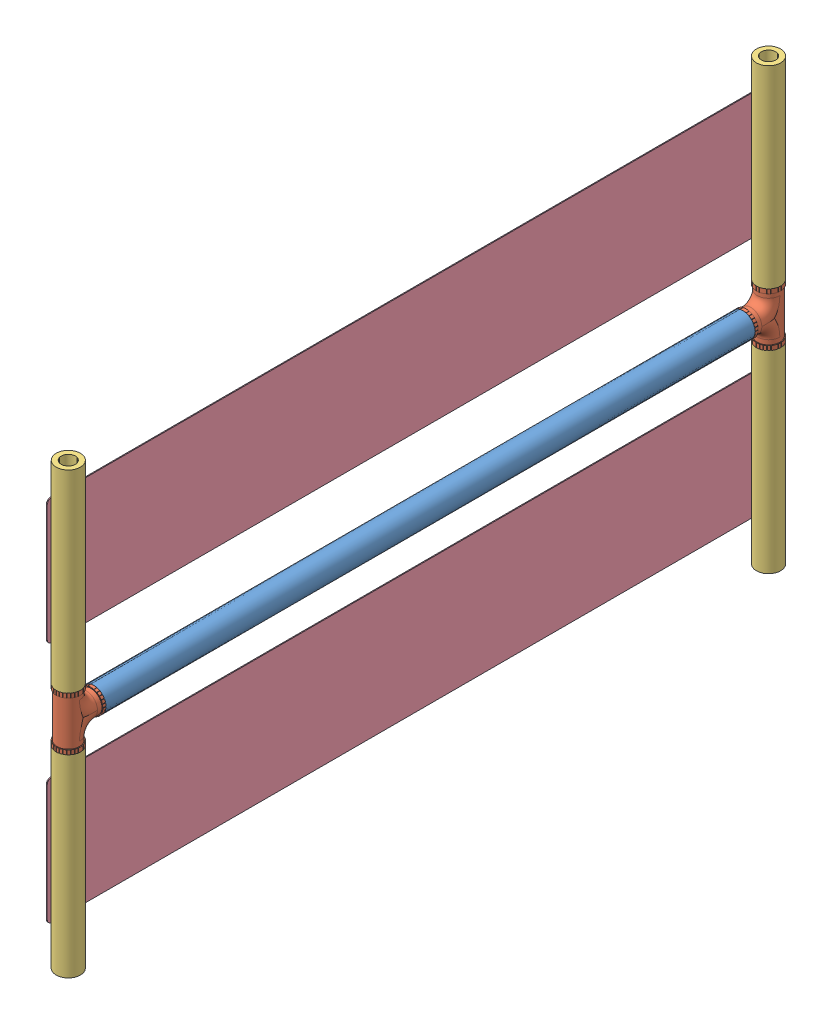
SolidWorks assembly CP003_CAD_Assy.SLDASM, configuration Default (file format 12000). Lengths in mm.
Overall size (28.35 490 807.23).
9 component instances, 4 part files, 24 mates.
Components (placement in the parent):
- CP003_CAD_Tube_L-1: CP003_CAD_Tube_L.SLDPRT [Default] at (222.3691 367.7474 997.1395) size (27 27 730)
- CP003_CAD_Tee-1: CP003_CAD_Tee.SLDPRT [Default] at (222.3691 346.2474 1022.1395) x (-1 0 0) z (0 1 0) size (27.35 42 59.5)
- CP003_CAD_Tee-2: CP003_CAD_Tee.SLDPRT [Default] at (222.3691 346.2474 242.1395) x (1 0 0) z (0 1 0) size (27.35 42 59.5)
- CP003_CAD_Tube_S-1: CP003_CAD_Tube_S.SLDPRT [Default] at (222.3691 122.7474 1022.1395) x (0 0 1) z (0 -1 0) size (27 27 220)
- CP003_CAD_Tube_S-2: CP003_CAD_Tube_S.SLDPRT [Default] at (222.3691 392.7474 1022.1395) x (0 0 1) z (0 -1 0) size (27 27 220)
- CP003_CAD_Tube_S-3: CP003_CAD_Tube_S.SLDPRT [Default] at (222.3691 392.7474 242.1395) x (-0.017452 0 0.999848) z (0 -1 0) size (27 27 220)
- CP003_CAD_Tube_S-4: CP003_CAD_Tube_S.SLDPRT [Default] at (222.3691 122.7474 242.1395) x (0 0 1) z (0 -1 0) size (27 27 220)
- CP003_CAD_Sheet-1: CP003_CAD_Sheet.SLDPRT [Default] at (208.8691 232.7474 632.1395) x (0 1 0) z (-1 0 0) size (140 800 1)
- CP003_CAD_Sheet-2: CP003_CAD_Sheet.SLDPRT [Default] at (208.8691 502.7474 632.1395) x (0 1 0) z (-1 0 0) size (140 800 1)
Mates (geometry in assembly coordinates):
- Concentric1: concentric aligned: cylinder of Colombia_PlayPen_Tube_L-1 through (222.3691 367.7474 267.1395) axis (0 0 1) radius 13.5; cylinder of Colombia_PlayPen_Tee-1 through (222.3691 367.7474 967.1395) axis (0 0 1) radius 13.5
- Coincident1: coincident aligned: plane of Colombia_PlayPen_Tube_L-1 through (222.3691 367.7474 997.1395) normal (0 0 1); plane of Colombia_PlayPen_Tee-1 through (222.3691 367.7474 997.1395) normal (0 0 1)
- Coincident2: coincident anti-aligned: plane of Colombia_PlayPen_Tube_L-1 through (222.3691 367.7474 997.1395) normal (1 0 0); plane of Colombia_PlayPen_Tee-1 through (222.3691 346.2474 1022.1395) normal (-1 0 0)
- Concentric2: concentric anti-aligned: cylinder of Colombia_PlayPen_Tube_L-1 through (222.3691 367.7474 267.1395) axis (0 0 1) radius 13.5; cylinder of Colombia_PlayPen_Tee-2 through (222.3691 367.7474 297.1395) axis (0 0 -1) radius 13.5
- Coincident3: coincident aligned: plane of Colombia_PlayPen_Tube_L-1 through (222.3691 367.7474 267.1395) normal (0 0 -1); plane of Colombia_PlayPen_Tee-2 through (222.3691 367.7474 267.1395) normal (0 0 -1)
- Coincident4: coincident aligned: plane of Colombia_PlayPen_Tube_L-1 through (222.3691 367.7474 997.1395) normal (1 0 0); plane of Colombia_PlayPen_Tee-2 through (222.3691 346.2474 242.1395) normal (1 0 0)
- Concentric4: concentric anti-aligned: cylinder of Colombia_PlayPen_Tee-1 through (222.3691 316.2474 1022.1395) axis (0 1 0) radius 13.5; cylinder of Colombia_PlayPen_Tube_S-1 through (222.3691 342.7474 1022.1395) axis (0 -1 0) radius 13.5
- Coincident5: coincident aligned: plane of Colombia_PlayPen_Tee-1 through (222.3691 342.7474 1022.1395) normal (0 1 0); plane of Colombia_PlayPen_Tube_S-1 through (222.3691 342.7474 1022.1395) normal (0 1 0)
- Concentric5: concentric aligned: cylinder of Colombia_PlayPen_Tee-1 through (222.3691 419.2474 1022.1395) axis (0 -1 0) radius 13.5; cylinder of Colombia_PlayPen_Tube_S-2 through (222.3691 612.7474 1022.1395) axis (0 -1 0) radius 13.5
- Coincident6: coincident aligned: plane of Colombia_PlayPen_Tee-1 through (222.3691 392.7474 1022.1395) normal (0 -1 0); plane of Colombia_PlayPen_Tube_S-2 through (222.3691 392.7474 1022.1395) normal (0 -1 0)
- Concentric6: concentric anti-aligned: cylinder of Colombia_PlayPen_Tee-2 through (222.3691 316.2474 242.1395) axis (0 1 0) radius 13.5; cylinder of Colombia_PlayPen_Tube_S-4 through (222.3691 342.7474 242.1395) axis (0 -1 0) radius 13.5
- Coincident7: coincident aligned: plane of Colombia_PlayPen_Tee-2 through (222.3691 342.7474 242.1395) normal (0 1 0); plane of Colombia_PlayPen_Tube_S-4 through (222.3691 342.7474 242.1395) normal (0 1 0)
- Concentric7: concentric aligned: cylinder of Colombia_PlayPen_Tee-2 through (222.3691 419.2474 242.1395) axis (0 -1 0) radius 13.5; cylinder of Colombia_PlayPen_Tube_S-3 through (222.3691 612.7474 242.1395) axis (0 -1 0) radius 13.5
- Coincident8: coincident aligned: plane of Colombia_PlayPen_Tee-2 through (222.3691 392.7474 242.1395) normal (0 -1 0); plane of Colombia_PlayPen_Tube_S-3 through (222.3691 392.7474 242.1395) normal (0 -1 0)
- Perpendicular1: perpendicular: plane of Colombia_PlayPen_Tube_S-1 through (222.3691 122.7474 1022.1395) normal (-1 0 0)
- Angle1: planar angle = 1.570796 rad anti-aligned: plane of Colombia_PlayPen_Tube_S-2 through (222.3691 392.7474 1022.1395) normal (-1 0 0)
- Angle2: planar angle = 1.553343 rad anti-aligned: plane of Colombia_PlayPen_Tube_S-3 through (222.3691 392.7474 242.1395) normal (-0.999848 0 -0.017452)
- Perpendicular4: perpendicular: plane of Colombia_PlayPen_Tube_S-4 through (222.3691 122.7474 242.1395) normal (-1 0 0)
- Tangent1: tangent anti-aligned: cylinder of Colombia_PlayPen_Tube_S-4 through (222.3691 342.7474 242.1395) axis (0 -1 0) radius 13.5; plane of Colombia_PlayPen_Sheets-1 through (208.8691 167.7474 1027.1395) normal (1 0 0)
- Coincident13: coincident aligned: cylinder of Colombia_PlayPen_Tube_S-4 through (208.8691 182.7474 242.1395) axis (-1 0 0) radius 2; circle of Colombia_PlayPen_Sheets-1
- Concentric8: concentric anti-aligned: cylinder of Colombia_PlayPen_Tube_S-4 through (208.8691 282.7474 242.1395) axis (-1 0 0) radius 2; cylinder of Colombia_PlayPen_Sheets-1 through (207.8691 282.7474 242.1395) axis (1 0 0) radius 2
- Concentric9: concentric aligned: cylinder of Colombia_PlayPen_Tube_S-2 through (208.8691 452.7474 1022.1395) axis (1 0 0) radius 2; cylinder of Colombia_PlayPen_Sheets-2 through (207.8691 452.7474 1022.1395) axis (1 0 0) radius 2
- Concentric10: concentric aligned: cylinder of Colombia_PlayPen_Tube_S-2 through (208.8691 552.7474 1022.1395) axis (1 0 0) radius 2; cylinder of Colombia_PlayPen_Sheets-2 through (207.8691 552.7474 1022.1395) axis (1 0 0) radius 2
- Tangent2: tangent anti-aligned: cylinder of Colombia_PlayPen_Tube_S-2 through (222.3691 612.7474 1022.1395) axis (0 -1 0) radius 13.5; plane of Colombia_PlayPen_Sheets-2 through (208.8691 437.7474 1027.1395) normal (1 0 0)
